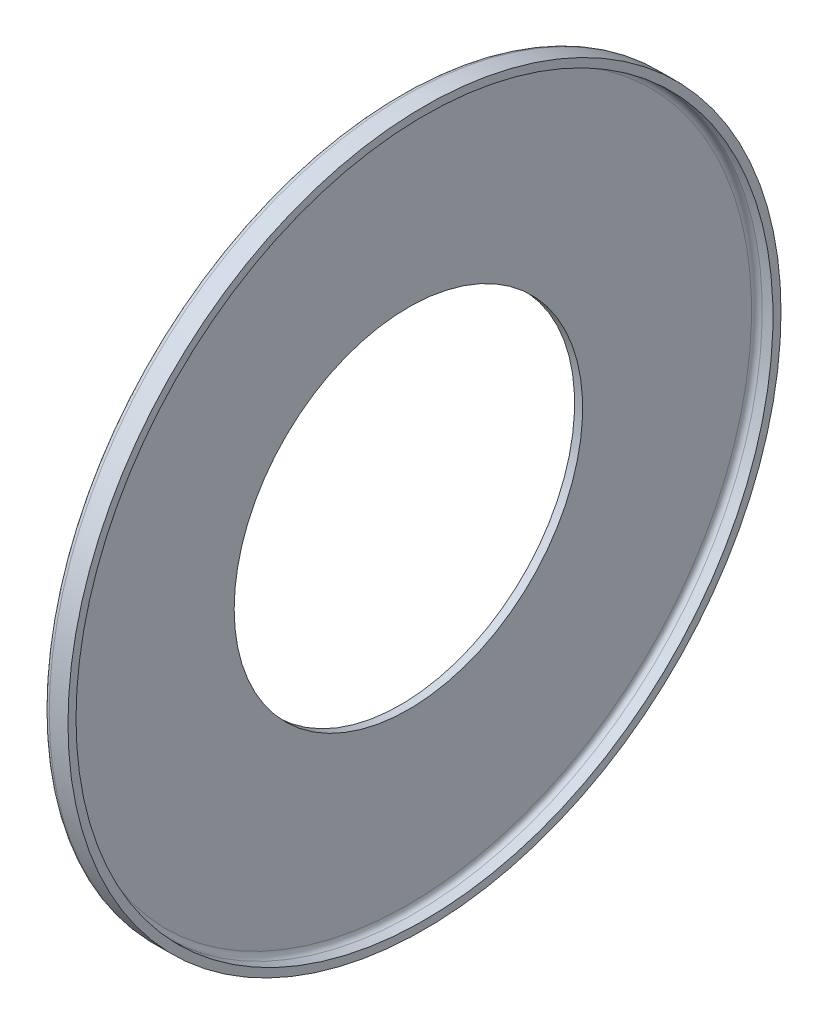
ISO-10303-21;
HEADER;
FILE_DESCRIPTION(('STEP AP214'),'2;1');
FILE_NAME('part.step','',(''),(''),'','','');
FILE_SCHEMA(('AUTOMOTIVE_DESIGN { 1 0 10303 214 1 1 1 1 }'));
ENDSEC;
DATA;
#1=APPLICATION_CONTEXT('core data for automotive mechanical design processes');
#2=APPLICATION_PROTOCOL_DEFINITION('international standard','automotive_design',2000,#1);
#3=PRODUCT_CONTEXT('',#1,'mechanical');
#4=PRODUCT('Part','Part','',(#3));
#5=PRODUCT_RELATED_PRODUCT_CATEGORY('part','',(#4));
#6=PRODUCT_DEFINITION_FORMATION('','',#4);
#7=PRODUCT_DEFINITION_CONTEXT('part definition',#1,'design');
#8=PRODUCT_DEFINITION('design','',#6,#7);
#9=PRODUCT_DEFINITION_SHAPE('','',#8);
#10=(LENGTH_UNIT() NAMED_UNIT(*) SI_UNIT(.MILLI.,.METRE.));
#11=(NAMED_UNIT(*) PLANE_ANGLE_UNIT() SI_UNIT($,.RADIAN.));
#12=(NAMED_UNIT(*) SI_UNIT($,.STERADIAN.) SOLID_ANGLE_UNIT());
#13=UNCERTAINTY_MEASURE_WITH_UNIT(LENGTH_MEASURE(1.E-05),#10,'distance_accuracy_value','');
#14=(GEOMETRIC_REPRESENTATION_CONTEXT(3) GLOBAL_UNCERTAINTY_ASSIGNED_CONTEXT((#13)) GLOBAL_UNIT_ASSIGNED_CONTEXT((#10,
#11,#12)) REPRESENTATION_CONTEXT('',''));
#15=CARTESIAN_POINT('',(0.,0.,0.));
#16=DIRECTION('',(0.,0.,1.));
#17=DIRECTION('',(1.,0.,0.));
#18=AXIS2_PLACEMENT_3D('',#15,#16,#17);
#19=CARTESIAN_POINT('',(-28.5000000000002,64.,1.11022302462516E-13));
#20=DIRECTION('',(-1.,0.,0.));
#21=DIRECTION('',(0.,0.,1.));
#22=AXIS2_PLACEMENT_3D('',#19,#20,#21);
#23=PLANE('',#22);
#24=CARTESIAN_POINT('',(-28.5000000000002,0.,0.));
#25=DIRECTION('',(-1.,0.,0.));
#26=DIRECTION('',(0.,0.,1.));
#27=AXIS2_PLACEMENT_3D('',#24,#25,#26);
#28=CIRCLE('',#27,64.);
#29=CARTESIAN_POINT('',(-28.5000000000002,0.,64.0000000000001));
#30=VERTEX_POINT('',#29);
#31=EDGE_CURVE('E10',#30,#30,#28,.T.);
#32=ORIENTED_EDGE('',*,*,#31,.F.);
#33=EDGE_LOOP('',(#32));
#34=FACE_BOUND('',#33,.T.);
#35=CARTESIAN_POINT('',(-28.5000000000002,0.,0.));
#36=DIRECTION('',(-1.,0.,0.));
#37=DIRECTION('',(0.,0.,1.));
#38=AXIS2_PLACEMENT_3D('',#35,#36,#37);
#39=CIRCLE('',#38,32.5);
#40=CARTESIAN_POINT('',(-28.5000000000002,-2.50735417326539E-13,32.5000000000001));
#41=VERTEX_POINT('',#40);
#42=EDGE_CURVE('E62',#41,#41,#39,.T.);
#43=ORIENTED_EDGE('',*,*,#42,.T.);
#44=EDGE_LOOP('',(#43));
#45=FACE_BOUND('',#44,.T.);
#46=ADVANCED_FACE('F34',(#34,#45),#23,.F.);
#47=CARTESIAN_POINT('',(-27.4999999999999,-3.33066907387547E-13,-2.22044604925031E-13));
#48=DIRECTION('',(-1.,0.,0.));
#49=DIRECTION('',(0.,0.,1.));
#50=AXIS2_PLACEMENT_3D('',#47,#48,#49);
#51=TOROIDAL_SURFACE('',#50,64.,1.);
#52=CARTESIAN_POINT('',(-27.4999999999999,-3.33066907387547E-13,-2.22044604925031E-13));
#53=DIRECTION('',(-1.,0.,0.));
#54=DIRECTION('',(0.,0.,1.));
#55=AXIS2_PLACEMENT_3D('',#52,#53,#54);
#56=CIRCLE('',#55,65.);
#57=CARTESIAN_POINT('',(-27.4999999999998,-2.51036671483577E-13,65.0000000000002));
#58=VERTEX_POINT('',#57);
#59=EDGE_CURVE('E40',#58,#58,#56,.T.);
#60=ORIENTED_EDGE('',*,*,#59,.F.);
#61=EDGE_LOOP('',(#60));
#62=FACE_BOUND('',#61,.T.);
#63=ORIENTED_EDGE('',*,*,#31,.T.);
#64=EDGE_LOOP('',(#63));
#65=FACE_BOUND('',#64,.T.);
#66=ADVANCED_FACE('F99',(#62,#65),#51,.F.);
#67=CARTESIAN_POINT('',(-100.,-2.4980018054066E-13,1.11022302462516E-13));
#68=DIRECTION('',(-1.,0.,0.));
#69=DIRECTION('',(0.,0.,1.));
#70=AXIS2_PLACEMENT_3D('',#67,#68,#69);
#71=CYLINDRICAL_SURFACE('',#70,65.);
#72=CARTESIAN_POINT('',(-25.5000000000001,0.,0.));
#73=DIRECTION('',(-1.,0.,0.));
#74=DIRECTION('',(0.,0.,1.));
#75=AXIS2_PLACEMENT_3D('',#72,#73,#74);
#76=CIRCLE('',#75,65.);
#77=CARTESIAN_POINT('',(-25.5000000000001,-2.51054656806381E-13,65.0000000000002));
#78=VERTEX_POINT('',#77);
#79=EDGE_CURVE('E44',#78,#78,#76,.T.);
#80=CARTESIAN_POINT('',(-25.5000000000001,-2.51054656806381E-13,65.0000000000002));
#81=CARTESIAN_POINT('',(-25.5208333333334,-2.51054469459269E-13,65.0000000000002));
#82=CARTESIAN_POINT('',(-25.5416666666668,-2.51054282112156E-13,65.0000000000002));
#83=CARTESIAN_POINT('',(-25.5833333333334,-2.51053907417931E-13,65.0000000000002));
#84=CARTESIAN_POINT('',(-25.6041666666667,-2.51053720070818E-13,65.0000000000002));
#85=CARTESIAN_POINT('',(-25.6458333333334,-2.51053345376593E-13,65.0000000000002));
#86=CARTESIAN_POINT('',(-25.6666666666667,-2.51053158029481E-13,65.0000000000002));
#87=CARTESIAN_POINT('',(-25.7083333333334,-2.51052783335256E-13,65.0000000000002));
#88=CARTESIAN_POINT('',(-25.7291666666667,-2.51052595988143E-13,65.0000000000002));
#89=CARTESIAN_POINT('',(-25.7708333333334,-2.51052221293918E-13,65.0000000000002));
#90=CARTESIAN_POINT('',(-25.7916666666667,-2.51052033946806E-13,65.0000000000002));
#91=CARTESIAN_POINT('',(-25.8333333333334,-2.5105165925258E-13,65.0000000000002));
#92=CARTESIAN_POINT('',(-25.8541666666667,-2.51051471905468E-13,65.0000000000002));
#93=CARTESIAN_POINT('',(-25.8958333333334,-2.51051097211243E-13,65.0000000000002));
#94=CARTESIAN_POINT('',(-25.9166666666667,-2.5105090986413E-13,65.0000000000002));
#95=CARTESIAN_POINT('',(-25.9583333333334,-2.51050535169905E-13,65.0000000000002));
#96=CARTESIAN_POINT('',(-25.9791666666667,-2.51050347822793E-13,65.0000000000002));
#97=CARTESIAN_POINT('',(-26.0208333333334,-2.51049973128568E-13,65.0000000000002));
#98=CARTESIAN_POINT('',(-26.0416666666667,-2.51049785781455E-13,65.0000000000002));
#99=CARTESIAN_POINT('',(-26.0833333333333,-2.5104941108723E-13,65.0000000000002));
#100=CARTESIAN_POINT('',(-26.1041666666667,-2.51049223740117E-13,65.0000000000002));
#101=CARTESIAN_POINT('',(-26.1458333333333,-2.51048849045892E-13,65.0000000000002));
#102=CARTESIAN_POINT('',(-26.1666666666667,-2.5104866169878E-13,65.0000000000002));
#103=CARTESIAN_POINT('',(-26.2083333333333,-2.51048287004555E-13,65.0000000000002));
#104=CARTESIAN_POINT('',(-26.2291666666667,-2.51048099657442E-13,65.0000000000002));
#105=CARTESIAN_POINT('',(-26.2708333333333,-2.51047724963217E-13,65.0000000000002));
#106=CARTESIAN_POINT('',(-26.2916666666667,-2.51047537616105E-13,65.0000000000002));
#107=CARTESIAN_POINT('',(-26.3333333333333,-2.51047162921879E-13,65.0000000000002));
#108=CARTESIAN_POINT('',(-26.3541666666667,-2.51046975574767E-13,65.0000000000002));
#109=CARTESIAN_POINT('',(-26.3958333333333,-2.51046600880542E-13,65.0000000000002));
#110=CARTESIAN_POINT('',(-26.4166666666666,-2.51046413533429E-13,65.0000000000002));
#111=CARTESIAN_POINT('',(-26.4583333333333,-2.51046038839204E-13,65.0000000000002));
#112=CARTESIAN_POINT('',(-26.4791666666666,-2.51045851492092E-13,65.0000000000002));
#113=CARTESIAN_POINT('',(-26.5208333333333,-2.51045476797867E-13,65.0000000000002));
#114=CARTESIAN_POINT('',(-26.5416666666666,-2.51045289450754E-13,65.0000000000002));
#115=CARTESIAN_POINT('',(-26.5833333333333,-2.51044914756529E-13,65.0000000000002));
#116=CARTESIAN_POINT('',(-26.6041666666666,-2.51044727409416E-13,65.0000000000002));
#117=CARTESIAN_POINT('',(-26.6458333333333,-2.51044352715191E-13,65.0000000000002));
#118=CARTESIAN_POINT('',(-26.6666666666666,-2.51044165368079E-13,65.0000000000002));
#119=CARTESIAN_POINT('',(-26.7083333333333,-2.51043790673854E-13,65.0000000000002));
#120=CARTESIAN_POINT('',(-26.7291666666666,-2.51043603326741E-13,65.0000000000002));
#121=CARTESIAN_POINT('',(-26.7708333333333,-2.51043228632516E-13,65.0000000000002));
#122=CARTESIAN_POINT('',(-26.7916666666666,-2.51043041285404E-13,65.0000000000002));
#123=CARTESIAN_POINT('',(-26.8333333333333,-2.51042666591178E-13,65.0000000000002));
#124=CARTESIAN_POINT('',(-26.8541666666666,-2.51042479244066E-13,65.0000000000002));
#125=CARTESIAN_POINT('',(-26.8958333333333,-2.51042104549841E-13,65.0000000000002));
#126=CARTESIAN_POINT('',(-26.9166666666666,-2.51041917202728E-13,65.0000000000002));
#127=CARTESIAN_POINT('',(-26.9583333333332,-2.51041542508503E-13,65.0000000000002));
#128=CARTESIAN_POINT('',(-26.9791666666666,-2.51041355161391E-13,65.0000000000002));
#129=CARTESIAN_POINT('',(-27.0208333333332,-2.51040980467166E-13,65.0000000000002));
#130=CARTESIAN_POINT('',(-27.0416666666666,-2.51040793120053E-13,65.0000000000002));
#131=CARTESIAN_POINT('',(-27.0833333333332,-2.51040418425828E-13,65.0000000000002));
#132=CARTESIAN_POINT('',(-27.1041666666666,-2.51040231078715E-13,65.0000000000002));
#133=CARTESIAN_POINT('',(-27.1458333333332,-2.5103985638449E-13,65.0000000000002));
#134=CARTESIAN_POINT('',(-27.1666666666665,-2.51039669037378E-13,65.0000000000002));
#135=CARTESIAN_POINT('',(-27.2083333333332,-2.51039294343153E-13,65.0000000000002));
#136=CARTESIAN_POINT('',(-27.2291666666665,-2.5103910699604E-13,65.0000000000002));
#137=CARTESIAN_POINT('',(-27.2708333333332,-2.51038732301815E-13,65.0000000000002));
#138=CARTESIAN_POINT('',(-27.2916666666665,-2.51038544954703E-13,65.0000000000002));
#139=CARTESIAN_POINT('',(-27.3333333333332,-2.51038170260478E-13,65.0000000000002));
#140=CARTESIAN_POINT('',(-27.3541666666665,-2.51037982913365E-13,65.0000000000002));
#141=CARTESIAN_POINT('',(-27.3958333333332,-2.5103760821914E-13,65.0000000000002));
#142=CARTESIAN_POINT('',(-27.4166666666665,-2.51037420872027E-13,65.0000000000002));
#143=CARTESIAN_POINT('',(-27.4583333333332,-2.51037046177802E-13,65.0000000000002));
#144=CARTESIAN_POINT('',(-27.4791666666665,-2.5103685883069E-13,65.0000000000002));
#145=CARTESIAN_POINT('',(-27.4999999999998,-2.51036671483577E-13,65.0000000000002));
#146=B_SPLINE_CURVE_WITH_KNOTS('',3,(#80,#81,#82,#83,#84,#85,#86,#87,#88,#89,#90,#91,#92,#93,
#94,#95,#96,#97,#98,#99,#100,#101,#102,#103,#104,#105,#106,#107,#108,#109,#110,#111,#112,#113,
#114,#115,#116,#117,#118,#119,#120,#121,#122,#123,#124,#125,#126,#127,#128,#129,#130,#131,#132,
#133,#134,#135,#136,#137,#138,#139,#140,#141,#142,#143,#144,#145),.UNSPECIFIED.,.F.,.F.,(4,2,2,
2,2,2,2,2,2,2,2,2,2,2,2,2,2,2,2,2,2,2,2,2,2,2,2,2,2,2,2,2,4),(0.,0.0624999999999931,
0.124999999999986,0.187499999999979,0.249999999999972,0.312499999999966,0.374999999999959,
0.437499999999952,0.499999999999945,0.562499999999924,0.624999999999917,0.68749999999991,
0.749999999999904,0.812499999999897,0.87499999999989,0.937499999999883,0.999999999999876,
1.06249999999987,1.12499999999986,1.18749999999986,1.24999999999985,1.31249999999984,
1.37499999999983,1.43749999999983,1.49999999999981,1.5624999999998,1.62499999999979,
1.68749999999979,1.74999999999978,1.81249999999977,1.87499999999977,1.93749999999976,
1.99999999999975),.UNSPECIFIED.);
#147=EDGE_CURVE('BSEAM94',#78,#58,#146,.T.);
#148=ORIENTED_EDGE('',*,*,#79,.F.);
#149=ORIENTED_EDGE('',*,*,#59,.T.);
#150=ORIENTED_EDGE('',*,*,#147,.T.);
#151=ORIENTED_EDGE('',*,*,#147,.F.);
#152=EDGE_LOOP('',(#148,#150,#149,#151));
#153=FACE_BOUND('',#152,.T.);
#154=ADVANCED_FACE('F94',(#153),#71,.F.);
#155=CARTESIAN_POINT('',(-25.4999999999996,66.5,2.22044604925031E-13));
#156=DIRECTION('',(-1.,0.,0.));
#157=DIRECTION('',(0.,0.,1.));
#158=AXIS2_PLACEMENT_3D('',#155,#156,#157);
#159=PLANE('',#158);
#160=CARTESIAN_POINT('',(-25.5000000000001,0.,0.));
#161=DIRECTION('',(-1.,0.,0.));
#162=DIRECTION('',(0.,0.,1.));
#163=AXIS2_PLACEMENT_3D('',#160,#161,#162);
#164=CIRCLE('',#163,66.5);
#165=CARTESIAN_POINT('',(-25.5000000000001,-2.51068145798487E-13,66.5000000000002));
#166=VERTEX_POINT('',#165);
#167=EDGE_CURVE('E48',#166,#166,#164,.T.);
#168=ORIENTED_EDGE('',*,*,#167,.F.);
#169=EDGE_LOOP('',(#168));
#170=FACE_BOUND('',#169,.T.);
#171=ORIENTED_EDGE('',*,*,#79,.T.);
#172=EDGE_LOOP('',(#171));
#173=FACE_BOUND('',#172,.T.);
#174=ADVANCED_FACE('F88',(#170,#173),#159,.F.);
#175=CARTESIAN_POINT('',(-100.,-2.4980018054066E-13,1.11022302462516E-13));
#176=DIRECTION('',(-1.,0.,0.));
#177=DIRECTION('',(0.,0.,1.));
#178=AXIS2_PLACEMENT_3D('',#175,#176,#177);
#179=CYLINDRICAL_SURFACE('',#178,66.5);
#180=CARTESIAN_POINT('',(-28.9999999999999,-1.38777878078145E-13,0.));
#181=DIRECTION('',(-1.,0.,0.));
#182=DIRECTION('',(0.,0.,1.));
#183=AXIS2_PLACEMENT_3D('',#180,#181,#182);
#184=CIRCLE('',#183,66.5);
#185=CARTESIAN_POINT('',(-28.9999999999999,-2.51036671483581E-13,66.5000000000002));
#186=VERTEX_POINT('',#185);
#187=EDGE_CURVE('E53',#186,#186,#184,.T.);
#188=CARTESIAN_POINT('',(-28.9999999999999,-2.51036671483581E-13,66.5000000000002));
#189=CARTESIAN_POINT('',(-28.9635416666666,-2.51036999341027E-13,66.5000000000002));
#190=CARTESIAN_POINT('',(-28.9270833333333,-2.51037327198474E-13,66.5000000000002));
#191=CARTESIAN_POINT('',(-28.8541666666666,-2.51037982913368E-13,66.5000000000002));
#192=CARTESIAN_POINT('',(-28.8177083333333,-2.51038310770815E-13,66.5000000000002));
#193=CARTESIAN_POINT('',(-28.7447916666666,-2.51038966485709E-13,66.5000000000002));
#194=CARTESIAN_POINT('',(-28.7083333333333,-2.51039294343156E-13,66.5000000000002));
#195=CARTESIAN_POINT('',(-28.6354166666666,-2.5103995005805E-13,66.5000000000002));
#196=CARTESIAN_POINT('',(-28.5989583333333,-2.51040277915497E-13,66.5000000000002));
#197=CARTESIAN_POINT('',(-28.5260416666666,-2.51040933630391E-13,66.5000000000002));
#198=CARTESIAN_POINT('',(-28.4895833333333,-2.51041261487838E-13,66.5000000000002));
#199=CARTESIAN_POINT('',(-28.4166666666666,-2.51041917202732E-13,66.5000000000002));
#200=CARTESIAN_POINT('',(-28.3802083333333,-2.51042245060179E-13,66.5000000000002));
#201=CARTESIAN_POINT('',(-28.3072916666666,-2.51042900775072E-13,66.5000000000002));
#202=CARTESIAN_POINT('',(-28.2708333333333,-2.51043228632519E-13,66.5000000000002));
#203=CARTESIAN_POINT('',(-28.1979166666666,-2.51043884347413E-13,66.5000000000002));
#204=CARTESIAN_POINT('',(-28.1614583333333,-2.5104421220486E-13,66.5000000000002));
#205=CARTESIAN_POINT('',(-28.0885416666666,-2.51044867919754E-13,66.5000000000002));
#206=CARTESIAN_POINT('',(-28.0520833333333,-2.51045195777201E-13,66.5000000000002));
#207=CARTESIAN_POINT('',(-27.9791666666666,-2.51045851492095E-13,66.5000000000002));
#208=CARTESIAN_POINT('',(-27.9427083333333,-2.51046179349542E-13,66.5000000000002));
#209=CARTESIAN_POINT('',(-27.8697916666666,-2.51046835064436E-13,66.5000000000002));
#210=CARTESIAN_POINT('',(-27.8333333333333,-2.51047162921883E-13,66.5000000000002));
#211=CARTESIAN_POINT('',(-27.7604166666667,-2.51047818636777E-13,66.5000000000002));
#212=CARTESIAN_POINT('',(-27.7239583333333,-2.51048146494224E-13,66.5000000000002));
#213=CARTESIAN_POINT('',(-27.6510416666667,-2.51048802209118E-13,66.5000000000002));
#214=CARTESIAN_POINT('',(-27.6145833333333,-2.51049130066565E-13,66.5000000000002));
#215=CARTESIAN_POINT('',(-27.5416666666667,-2.51049785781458E-13,66.5000000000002));
#216=CARTESIAN_POINT('',(-27.5052083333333,-2.51050113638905E-13,66.5000000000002));
#217=CARTESIAN_POINT('',(-27.4322916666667,-2.51050769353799E-13,66.5000000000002));
#218=CARTESIAN_POINT('',(-27.3958333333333,-2.51051097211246E-13,66.5000000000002));
#219=CARTESIAN_POINT('',(-27.3229166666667,-2.5105175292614E-13,66.5000000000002));
#220=CARTESIAN_POINT('',(-27.2864583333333,-2.51052080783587E-13,66.5000000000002));
#221=CARTESIAN_POINT('',(-27.2135416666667,-2.51052736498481E-13,66.5000000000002));
#222=CARTESIAN_POINT('',(-27.1770833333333,-2.51053064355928E-13,66.5000000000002));
#223=CARTESIAN_POINT('',(-27.1041666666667,-2.51053720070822E-13,66.5000000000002));
#224=CARTESIAN_POINT('',(-27.0677083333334,-2.51054047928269E-13,66.5000000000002));
#225=CARTESIAN_POINT('',(-26.9947916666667,-2.51054703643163E-13,66.5000000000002));
#226=CARTESIAN_POINT('',(-26.9583333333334,-2.5105503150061E-13,66.5000000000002));
#227=CARTESIAN_POINT('',(-26.8854166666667,-2.51055687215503E-13,66.5000000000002));
#228=CARTESIAN_POINT('',(-26.8489583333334,-2.5105601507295E-13,66.5000000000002));
#229=CARTESIAN_POINT('',(-26.7760416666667,-2.51056670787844E-13,66.5000000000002));
#230=CARTESIAN_POINT('',(-26.7395833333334,-2.51056998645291E-13,66.5000000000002));
#231=CARTESIAN_POINT('',(-26.6666666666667,-2.51057654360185E-13,66.5000000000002));
#232=CARTESIAN_POINT('',(-26.6302083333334,-2.51057982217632E-13,66.5000000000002));
#233=CARTESIAN_POINT('',(-26.5572916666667,-2.51058637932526E-13,66.5000000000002));
#234=CARTESIAN_POINT('',(-26.5208333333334,-2.51058965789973E-13,66.5000000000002));
#235=CARTESIAN_POINT('',(-26.4479166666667,-2.51059621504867E-13,66.5000000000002));
#236=CARTESIAN_POINT('',(-26.4114583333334,-2.51059949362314E-13,66.5000000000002));
#237=CARTESIAN_POINT('',(-26.3385416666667,-2.51060605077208E-13,66.5000000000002));
#238=CARTESIAN_POINT('',(-26.3020833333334,-2.51060932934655E-13,66.5000000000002));
#239=CARTESIAN_POINT('',(-26.2291666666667,-2.51061588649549E-13,66.5000000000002));
#240=CARTESIAN_POINT('',(-26.1927083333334,-2.51061916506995E-13,66.5000000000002));
#241=CARTESIAN_POINT('',(-26.1197916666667,-2.51062572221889E-13,66.5000000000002));
#242=CARTESIAN_POINT('',(-26.0833333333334,-2.51062900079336E-13,66.5000000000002));
#243=CARTESIAN_POINT('',(-26.0104166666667,-2.5106355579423E-13,66.5000000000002));
#244=CARTESIAN_POINT('',(-25.9739583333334,-2.51063883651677E-13,66.5000000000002));
#245=CARTESIAN_POINT('',(-25.9010416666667,-2.51064539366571E-13,66.5000000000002));
#246=CARTESIAN_POINT('',(-25.8645833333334,-2.51064867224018E-13,66.5000000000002));
#247=CARTESIAN_POINT('',(-25.7916666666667,-2.51065522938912E-13,66.5000000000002));
#248=CARTESIAN_POINT('',(-25.7552083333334,-2.51065850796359E-13,66.5000000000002));
#249=CARTESIAN_POINT('',(-25.6822916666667,-2.51066506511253E-13,66.5000000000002));
#250=CARTESIAN_POINT('',(-25.6458333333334,-2.510668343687E-13,66.5000000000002));
#251=CARTESIAN_POINT('',(-25.5729166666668,-2.51067490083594E-13,66.5000000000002));
#252=CARTESIAN_POINT('',(-25.5364583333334,-2.5106781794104E-13,66.5000000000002));
#253=CARTESIAN_POINT('',(-25.5000000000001,-2.51068145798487E-13,66.5000000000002));
#254=B_SPLINE_CURVE_WITH_KNOTS('',3,(#188,#189,#190,#191,#192,#193,#194,#195,#196,#197,#198,
#199,#200,#201,#202,#203,#204,#205,#206,#207,#208,#209,#210,#211,#212,#213,#214,#215,#216,#217,
#218,#219,#220,#221,#222,#223,#224,#225,#226,#227,#228,#229,#230,#231,#232,#233,#234,#235,#236,
#237,#238,#239,#240,#241,#242,#243,#244,#245,#246,#247,#248,#249,#250,#251,#252,#253),
.UNSPECIFIED.,.F.,.F.,(4,2,2,2,2,2,2,2,2,2,2,2,2,2,2,2,2,2,2,2,2,2,2,2,2,2,2,2,2,2,2,2,4),(0.,
0.109374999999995,0.21874999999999,0.328124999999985,0.43749999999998,0.546874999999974,
0.656249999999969,0.765624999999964,0.874999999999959,0.984374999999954,1.09374999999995,
1.20312499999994,1.31249999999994,1.42187499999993,1.53124999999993,1.64062499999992,
1.74999999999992,1.85937499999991,1.96874999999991,2.0781249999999,2.1874999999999,
2.29687499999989,2.40624999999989,2.51562499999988,2.62499999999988,2.73437499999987,
2.84374999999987,2.95312499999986,3.06249999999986,3.17187499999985,3.28124999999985,
3.39062499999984,3.49999999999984),.UNSPECIFIED.);
#255=EDGE_CURVE('BSEAM82',#186,#166,#254,.T.);
#256=ORIENTED_EDGE('',*,*,#187,.F.);
#257=ORIENTED_EDGE('',*,*,#167,.T.);
#258=ORIENTED_EDGE('',*,*,#255,.T.);
#259=ORIENTED_EDGE('',*,*,#255,.F.);
#260=EDGE_LOOP('',(#256,#258,#257,#259));
#261=FACE_BOUND('',#260,.T.);
#262=ADVANCED_FACE('F82',(#261),#179,.T.);
#263=CARTESIAN_POINT('',(-28.9999999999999,-1.38777878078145E-13,0.));
#264=DIRECTION('',(-1.,0.,0.));
#265=DIRECTION('',(0.,0.,1.));
#266=AXIS2_PLACEMENT_3D('',#263,#264,#265);
#267=TOROIDAL_SURFACE('',#266,65.5,1.);
#268=CARTESIAN_POINT('',(-30.0000000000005,0.,0.));
#269=DIRECTION('',(-1.,0.,0.));
#270=DIRECTION('',(0.,0.,1.));
#271=AXIS2_PLACEMENT_3D('',#268,#269,#270);
#272=CIRCLE('',#271,65.5);
#273=CARTESIAN_POINT('',(-30.0000000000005,0.,65.5000000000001));
#274=VERTEX_POINT('',#273);
#275=EDGE_CURVE('E56',#274,#274,#272,.T.);
#276=ORIENTED_EDGE('',*,*,#275,.F.);
#277=EDGE_LOOP('',(#276));
#278=FACE_BOUND('',#277,.T.);
#279=ORIENTED_EDGE('',*,*,#187,.T.);
#280=EDGE_LOOP('',(#279));
#281=FACE_BOUND('',#280,.T.);
#282=ADVANCED_FACE('F76',(#278,#281),#267,.T.);
#283=CARTESIAN_POINT('',(-30.0000000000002,65.4999999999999,2.22044604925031E-13));
#284=DIRECTION('',(1.,0.,0.));
#285=DIRECTION('',(0.,0.,-1.));
#286=AXIS2_PLACEMENT_3D('',#283,#284,#285);
#287=PLANE('',#286);
#288=CARTESIAN_POINT('',(-30.0000000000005,0.,0.));
#289=DIRECTION('',(-1.,0.,0.));
#290=DIRECTION('',(0.,0.,1.));
#291=AXIS2_PLACEMENT_3D('',#288,#289,#290);
#292=CIRCLE('',#291,32.5);
#293=CARTESIAN_POINT('',(-30.0000000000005,-2.50721928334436E-13,32.5000000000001));
#294=VERTEX_POINT('',#293);
#295=EDGE_CURVE('E59',#294,#294,#292,.T.);
#296=ORIENTED_EDGE('',*,*,#295,.F.);
#297=EDGE_LOOP('',(#296));
#298=FACE_BOUND('',#297,.T.);
#299=ORIENTED_EDGE('',*,*,#275,.T.);
#300=EDGE_LOOP('',(#299));
#301=FACE_BOUND('',#300,.T.);
#302=ADVANCED_FACE('F70',(#298,#301),#287,.F.);
#303=CARTESIAN_POINT('',(-100.,-2.4980018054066E-13,1.11022302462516E-13));
#304=DIRECTION('',(-1.,0.,0.));
#305=DIRECTION('',(0.,0.,1.));
#306=AXIS2_PLACEMENT_3D('',#303,#304,#305);
#307=CYLINDRICAL_SURFACE('',#306,32.5);
#308=CARTESIAN_POINT('',(-28.5000000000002,-2.50735417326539E-13,32.5000000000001));
#309=CARTESIAN_POINT('',(-28.5156250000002,-2.50735276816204E-13,32.5000000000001));
#310=CARTESIAN_POINT('',(-28.5312500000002,-2.5073513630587E-13,32.5000000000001));
#311=CARTESIAN_POINT('',(-28.5625000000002,-2.50734855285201E-13,32.5000000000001));
#312=CARTESIAN_POINT('',(-28.5781250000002,-2.50734714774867E-13,32.5000000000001));
#313=CARTESIAN_POINT('',(-28.6093750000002,-2.50734433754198E-13,32.5000000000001));
#314=CARTESIAN_POINT('',(-28.6250000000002,-2.50734293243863E-13,32.5000000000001));
#315=CARTESIAN_POINT('',(-28.6562500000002,-2.50734012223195E-13,32.5000000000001));
#316=CARTESIAN_POINT('',(-28.6718750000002,-2.5073387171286E-13,32.5000000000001));
#317=CARTESIAN_POINT('',(-28.7031250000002,-2.50733590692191E-13,32.5000000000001));
#318=CARTESIAN_POINT('',(-28.7187500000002,-2.50733450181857E-13,32.5000000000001));
#319=CARTESIAN_POINT('',(-28.7500000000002,-2.50733169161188E-13,32.5000000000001));
#320=CARTESIAN_POINT('',(-28.7656250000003,-2.50733028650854E-13,32.5000000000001));
#321=CARTESIAN_POINT('',(-28.7968750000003,-2.50732747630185E-13,32.5000000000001));
#322=CARTESIAN_POINT('',(-28.8125000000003,-2.5073260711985E-13,32.5000000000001));
#323=CARTESIAN_POINT('',(-28.8437500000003,-2.50732326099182E-13,32.5000000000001));
#324=CARTESIAN_POINT('',(-28.8593750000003,-2.50732185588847E-13,32.5000000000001));
#325=CARTESIAN_POINT('',(-28.8906250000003,-2.50731904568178E-13,32.5000000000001));
#326=CARTESIAN_POINT('',(-28.9062500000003,-2.50731764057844E-13,32.5000000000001));
#327=CARTESIAN_POINT('',(-28.9375000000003,-2.50731483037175E-13,32.5000000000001));
#328=CARTESIAN_POINT('',(-28.9531250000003,-2.50731342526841E-13,32.5000000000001));
#329=CARTESIAN_POINT('',(-28.9843750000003,-2.50731061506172E-13,32.5000000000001));
#330=CARTESIAN_POINT('',(-29.0000000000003,-2.50730920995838E-13,32.5000000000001));
#331=CARTESIAN_POINT('',(-29.0312500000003,-2.50730639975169E-13,32.5000000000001));
#332=CARTESIAN_POINT('',(-29.0468750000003,-2.50730499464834E-13,32.5000000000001));
#333=CARTESIAN_POINT('',(-29.0781250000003,-2.50730218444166E-13,32.5000000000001));
#334=CARTESIAN_POINT('',(-29.0937500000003,-2.50730077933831E-13,32.5000000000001));
#335=CARTESIAN_POINT('',(-29.1250000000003,-2.50729796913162E-13,32.5000000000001));
#336=CARTESIAN_POINT('',(-29.1406250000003,-2.50729656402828E-13,32.5000000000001));
#337=CARTESIAN_POINT('',(-29.1718750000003,-2.50729375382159E-13,32.5000000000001));
#338=CARTESIAN_POINT('',(-29.1875000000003,-2.50729234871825E-13,32.5000000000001));
#339=CARTESIAN_POINT('',(-29.2187500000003,-2.50728953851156E-13,32.5000000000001));
#340=CARTESIAN_POINT('',(-29.2343750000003,-2.50728813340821E-13,32.5000000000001));
#341=CARTESIAN_POINT('',(-29.2656250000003,-2.50728532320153E-13,32.5000000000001));
#342=CARTESIAN_POINT('',(-29.2812500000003,-2.50728391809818E-13,32.5000000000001));
#343=CARTESIAN_POINT('',(-29.3125000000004,-2.50728110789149E-13,32.5000000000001));
#344=CARTESIAN_POINT('',(-29.3281250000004,-2.50727970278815E-13,32.5000000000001));
#345=CARTESIAN_POINT('',(-29.3593750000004,-2.50727689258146E-13,32.5000000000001));
#346=CARTESIAN_POINT('',(-29.3750000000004,-2.50727548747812E-13,32.5000000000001));
#347=CARTESIAN_POINT('',(-29.4062500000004,-2.50727267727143E-13,32.5000000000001));
#348=CARTESIAN_POINT('',(-29.4218750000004,-2.50727127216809E-13,32.5000000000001));
#349=CARTESIAN_POINT('',(-29.4531250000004,-2.5072684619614E-13,32.5000000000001));
#350=CARTESIAN_POINT('',(-29.4687500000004,-2.50726705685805E-13,32.5000000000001));
#351=CARTESIAN_POINT('',(-29.5000000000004,-2.50726424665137E-13,32.5000000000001));
#352=CARTESIAN_POINT('',(-29.5156250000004,-2.50726284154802E-13,32.5000000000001));
#353=CARTESIAN_POINT('',(-29.5468750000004,-2.50726003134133E-13,32.5000000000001));
#354=CARTESIAN_POINT('',(-29.5625000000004,-2.50725862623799E-13,32.5000000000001));
#355=CARTESIAN_POINT('',(-29.5937500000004,-2.5072558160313E-13,32.5000000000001));
#356=CARTESIAN_POINT('',(-29.6093750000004,-2.50725441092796E-13,32.5000000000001));
#357=CARTESIAN_POINT('',(-29.6406250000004,-2.50725160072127E-13,32.5000000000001));
#358=CARTESIAN_POINT('',(-29.6562500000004,-2.50725019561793E-13,32.5000000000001));
#359=CARTESIAN_POINT('',(-29.6875000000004,-2.50724738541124E-13,32.5000000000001));
#360=CARTESIAN_POINT('',(-29.7031250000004,-2.50724598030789E-13,32.5000000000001));
#361=CARTESIAN_POINT('',(-29.7343750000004,-2.5072431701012E-13,32.5000000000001));
#362=CARTESIAN_POINT('',(-29.7500000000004,-2.50724176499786E-13,32.5000000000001));
#363=CARTESIAN_POINT('',(-29.7812500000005,-2.50723895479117E-13,32.5000000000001));
#364=CARTESIAN_POINT('',(-29.7968750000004,-2.50723754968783E-13,32.5000000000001));
#365=CARTESIAN_POINT('',(-29.8281250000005,-2.50723473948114E-13,32.5000000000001));
#366=CARTESIAN_POINT('',(-29.8437500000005,-2.5072333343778E-13,32.5000000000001));
#367=CARTESIAN_POINT('',(-29.8750000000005,-2.50723052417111E-13,32.5000000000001));
#368=CARTESIAN_POINT('',(-29.8906250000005,-2.50722911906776E-13,32.5000000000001));
#369=CARTESIAN_POINT('',(-29.9218750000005,-2.50722630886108E-13,32.5000000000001));
#370=CARTESIAN_POINT('',(-29.9375000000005,-2.50722490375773E-13,32.5000000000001));
#371=CARTESIAN_POINT('',(-29.9687500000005,-2.50722209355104E-13,32.5000000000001));
#372=CARTESIAN_POINT('',(-29.9843750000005,-2.5072206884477E-13,32.5000000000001));
#373=CARTESIAN_POINT('',(-30.0000000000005,-2.50721928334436E-13,32.5000000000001));
#374=B_SPLINE_CURVE_WITH_KNOTS('',3,(#308,#309,#310,#311,#312,#313,#314,#315,#316,#317,#318,
#319,#320,#321,#322,#323,#324,#325,#326,#327,#328,#329,#330,#331,#332,#333,#334,#335,#336,#337,
#338,#339,#340,#341,#342,#343,#344,#345,#346,#347,#348,#349,#350,#351,#352,#353,#354,#355,#356,
#357,#358,#359,#360,#361,#362,#363,#364,#365,#366,#367,#368,#369,#370,#371,#372,#373),
.UNSPECIFIED.,.F.,.F.,(4,2,2,2,2,2,2,2,2,2,2,2,2,2,2,2,2,2,2,2,2,2,2,2,2,2,2,2,2,2,2,2,4),(0.,
0.0468750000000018,0.0937500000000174,0.140625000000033,0.187500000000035,0.234375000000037,
0.281250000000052,0.328125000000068,0.37500000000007,0.421875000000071,0.468750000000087,
0.515625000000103,0.562500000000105,0.609375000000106,0.656250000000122,0.703125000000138,
0.750000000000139,0.796875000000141,0.843750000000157,0.890625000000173,0.937500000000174,
0.984375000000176,1.03125000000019,1.07812500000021,1.12500000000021,1.17187500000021,
1.21875000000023,1.26562500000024,1.31250000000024,1.35937500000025,1.40625000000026,
1.45312500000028,1.50000000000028),.UNSPECIFIED.);
#375=EDGE_CURVE('BSEAM67',#41,#294,#374,.T.);
#376=ORIENTED_EDGE('',*,*,#42,.F.);
#377=ORIENTED_EDGE('',*,*,#295,.T.);
#378=ORIENTED_EDGE('',*,*,#375,.T.);
#379=ORIENTED_EDGE('',*,*,#375,.F.);
#380=EDGE_LOOP('',(#376,#378,#377,#379));
#381=FACE_BOUND('',#380,.T.);
#382=ADVANCED_FACE('F67',(#381),#307,.F.);
#383=CLOSED_SHELL('',(#46,#66,#154,#174,#262,#282,#302,#382));
#384=MANIFOLD_SOLID_BREP('B2',#383);
#385=ADVANCED_BREP_SHAPE_REPRESENTATION('',(#18,#384),#14);
#386=SHAPE_DEFINITION_REPRESENTATION(#9,#385);
ENDSEC;
END-ISO-10303-21;
